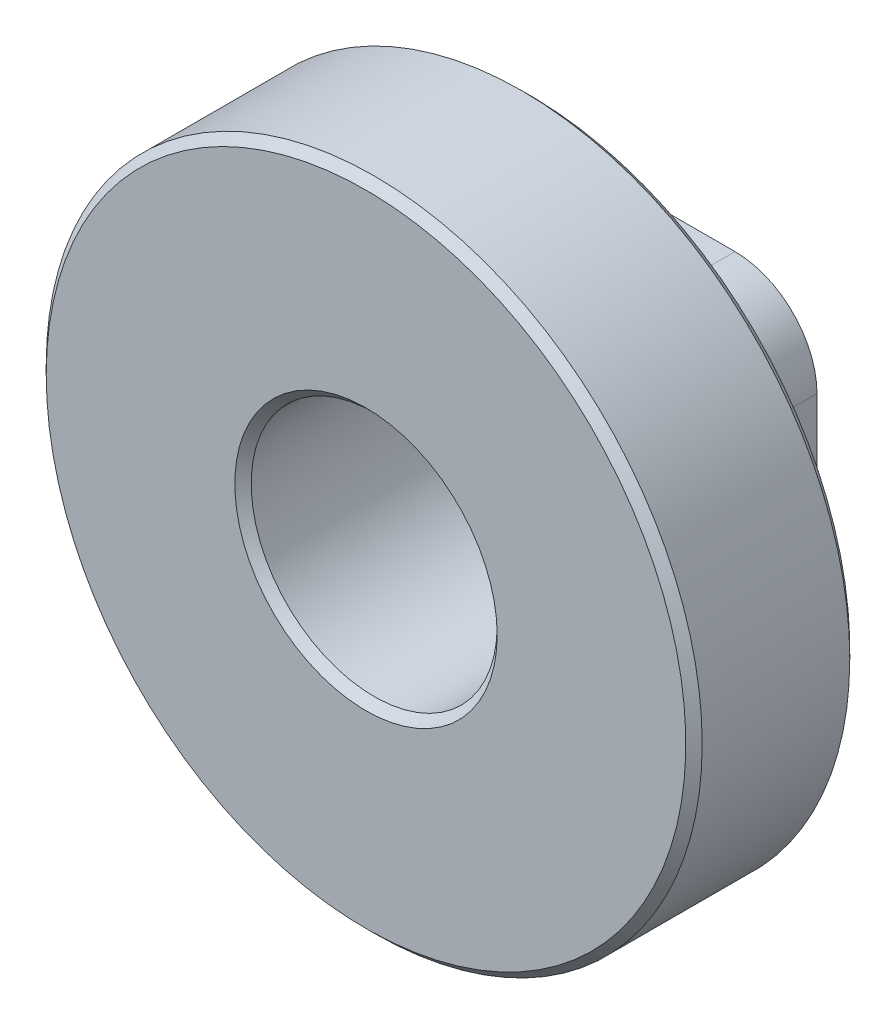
ISO-10303-21;
HEADER;
FILE_DESCRIPTION(('STEP AP214'),'2;1');
FILE_NAME('part.step','',(''),(''),'','','');
FILE_SCHEMA(('AUTOMOTIVE_DESIGN { 1 0 10303 214 1 1 1 1 }'));
ENDSEC;
DATA;
#1=APPLICATION_CONTEXT('core data for automotive mechanical design processes');
#2=APPLICATION_PROTOCOL_DEFINITION('international standard','automotive_design',2000,#1);
#3=PRODUCT_CONTEXT('',#1,'mechanical');
#4=PRODUCT('Part','Part','',(#3));
#5=PRODUCT_RELATED_PRODUCT_CATEGORY('part','',(#4));
#6=PRODUCT_DEFINITION_FORMATION('','',#4);
#7=PRODUCT_DEFINITION_CONTEXT('part definition',#1,'design');
#8=PRODUCT_DEFINITION('design','',#6,#7);
#9=PRODUCT_DEFINITION_SHAPE('','',#8);
#10=(LENGTH_UNIT() NAMED_UNIT(*) SI_UNIT(.MILLI.,.METRE.));
#11=(NAMED_UNIT(*) PLANE_ANGLE_UNIT() SI_UNIT($,.RADIAN.));
#12=(NAMED_UNIT(*) SI_UNIT($,.STERADIAN.) SOLID_ANGLE_UNIT());
#13=UNCERTAINTY_MEASURE_WITH_UNIT(LENGTH_MEASURE(1.E-05),#10,'distance_accuracy_value','');
#14=(GEOMETRIC_REPRESENTATION_CONTEXT(3) GLOBAL_UNCERTAINTY_ASSIGNED_CONTEXT((#13)) GLOBAL_UNIT_ASSIGNED_CONTEXT((#10,
#11,#12)) REPRESENTATION_CONTEXT('',''));
#15=CARTESIAN_POINT('',(0.,0.,0.));
#16=DIRECTION('',(0.,0.,1.));
#17=DIRECTION('',(1.,0.,0.));
#18=AXIS2_PLACEMENT_3D('',#15,#16,#17);
#19=CARTESIAN_POINT('',(0.,0.,-1.5));
#20=DIRECTION('',(0.,0.,1.));
#21=DIRECTION('',(1.,0.,0.));
#22=AXIS2_PLACEMENT_3D('',#19,#20,#21);
#23=PLANE('',#22);
#24=CARTESIAN_POINT('',(0.,0.,-1.5));
#25=DIRECTION('',(0.,0.,1.));
#26=DIRECTION('',(1.,0.,0.));
#27=AXIS2_PLACEMENT_3D('',#24,#25,#26);
#28=CIRCLE('',#27,1.6);
#29=CARTESIAN_POINT('',(1.6,0.,-1.5));
#30=VERTEX_POINT('',#29);
#31=EDGE_CURVE('E154',#30,#30,#28,.T.);
#32=ORIENTED_EDGE('',*,*,#31,.T.);
#33=EDGE_LOOP('',(#32));
#34=FACE_BOUND('',#33,.T.);
#35=CARTESIAN_POINT('',(1.50000000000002,1.5,-1.5));
#36=DIRECTION('',(0.,0.,-1.));
#37=DIRECTION('',(1.,0.,0.));
#38=AXIS2_PLACEMENT_3D('',#35,#36,#37);
#39=CIRCLE('',#38,1.);
#40=CARTESIAN_POINT('',(1.50000000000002,2.5,-1.5));
#41=VERTEX_POINT('',#40);
#42=CARTESIAN_POINT('',(2.50000000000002,1.5,-1.5));
#43=VERTEX_POINT('',#42);
#44=EDGE_CURVE('E116',#41,#43,#39,.T.);
#45=ORIENTED_EDGE('',*,*,#44,.T.);
#46=DIRECTION('',(0.,-1.,0.));
#47=VECTOR('',#46,1.);
#48=CARTESIAN_POINT('',(2.50000000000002,1.5,-1.5));
#49=LINE('',#48,#47);
#50=CARTESIAN_POINT('',(2.5,-1.5,-1.5));
#51=VERTEX_POINT('',#50);
#52=EDGE_CURVE('E114',#43,#51,#49,.T.);
#53=ORIENTED_EDGE('',*,*,#52,.T.);
#54=CARTESIAN_POINT('',(1.5,-1.5,-1.5));
#55=DIRECTION('',(0.,0.,-1.));
#56=DIRECTION('',(1.,0.,0.));
#57=AXIS2_PLACEMENT_3D('',#54,#55,#56);
#58=CIRCLE('',#57,1.);
#59=CARTESIAN_POINT('',(1.5,-2.5,-1.5));
#60=VERTEX_POINT('',#59);
#61=EDGE_CURVE('E46',#51,#60,#58,.T.);
#62=ORIENTED_EDGE('',*,*,#61,.T.);
#63=DIRECTION('',(-1.,0.,0.));
#64=VECTOR('',#63,1.);
#65=CARTESIAN_POINT('',(1.5,-2.5,-1.5));
#66=LINE('',#65,#64);
#67=CARTESIAN_POINT('',(-1.5,-2.5,-1.5));
#68=VERTEX_POINT('',#67);
#69=EDGE_CURVE('E104',#60,#68,#66,.T.);
#70=ORIENTED_EDGE('',*,*,#69,.T.);
#71=CARTESIAN_POINT('',(-1.5,-1.5,-1.5));
#72=DIRECTION('',(0.,0.,-1.));
#73=DIRECTION('',(1.,0.,0.));
#74=AXIS2_PLACEMENT_3D('',#71,#72,#73);
#75=CIRCLE('',#74,1.);
#76=CARTESIAN_POINT('',(-2.5,-1.5,-1.5));
#77=VERTEX_POINT('',#76);
#78=EDGE_CURVE('E109',#68,#77,#75,.T.);
#79=ORIENTED_EDGE('',*,*,#78,.T.);
#80=DIRECTION('',(0.,1.,0.));
#81=VECTOR('',#80,1.);
#82=CARTESIAN_POINT('',(-2.49999999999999,1.5,-1.5));
#83=LINE('',#82,#81);
#84=CARTESIAN_POINT('',(-2.49999999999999,1.5,-1.5));
#85=VERTEX_POINT('',#84);
#86=EDGE_CURVE('E121',#77,#85,#83,.T.);
#87=ORIENTED_EDGE('',*,*,#86,.T.);
#88=CARTESIAN_POINT('',(-1.49999999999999,1.5,-1.5));
#89=DIRECTION('',(0.,0.,-1.));
#90=DIRECTION('',(1.,0.,0.));
#91=AXIS2_PLACEMENT_3D('',#88,#89,#90);
#92=CIRCLE('',#91,1.);
#93=CARTESIAN_POINT('',(-1.49999999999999,2.5,-1.5));
#94=VERTEX_POINT('',#93);
#95=EDGE_CURVE('E124',#85,#94,#92,.T.);
#96=ORIENTED_EDGE('',*,*,#95,.T.);
#97=DIRECTION('',(1.,0.,0.));
#98=VECTOR('',#97,1.);
#99=CARTESIAN_POINT('',(1.50000000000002,2.5,-1.5));
#100=LINE('',#99,#98);
#101=EDGE_CURVE('E127',#94,#41,#100,.T.);
#102=ORIENTED_EDGE('',*,*,#101,.T.);
#103=EDGE_LOOP('',(#45,#53,#62,#70,#79,#87,#96,#102));
#104=FACE_BOUND('',#103,.T.);
#105=ADVANCED_FACE('F31',(#34,#104),#23,.F.);
#106=CARTESIAN_POINT('',(0.,0.,1.5));
#107=DIRECTION('',(0.,0.,-1.));
#108=DIRECTION('',(-1.,0.,0.));
#109=AXIS2_PLACEMENT_3D('',#106,#107,#108);
#110=CYLINDRICAL_SURFACE('',#109,4.);
#111=CARTESIAN_POINT('',(0.,0.,-0.399999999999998));
#112=DIRECTION('',(0.,0.,-1.));
#113=DIRECTION('',(-1.,0.,0.));
#114=AXIS2_PLACEMENT_3D('',#111,#112,#113);
#115=CIRCLE('',#114,4.);
#116=CARTESIAN_POINT('',(-4.00000000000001,0.,-0.399999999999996));
#117=VERTEX_POINT('',#116);
#118=EDGE_CURVE('E11',#117,#117,#115,.F.);
#119=CARTESIAN_POINT('',(0.,0.,1.4));
#120=DIRECTION('',(0.,0.,1.));
#121=DIRECTION('',(1.,0.,0.));
#122=AXIS2_PLACEMENT_3D('',#119,#120,#121);
#123=CIRCLE('',#122,4.);
#124=CARTESIAN_POINT('',(-4.00000000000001,0.,1.4));
#125=VERTEX_POINT('',#124);
#126=EDGE_CURVE('E178',#125,#125,#123,.F.);
#127=CARTESIAN_POINT('',(-4.00000000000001,0.,-0.399999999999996));
#128=CARTESIAN_POINT('',(-4.00000000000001,0.,-0.381249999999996));
#129=CARTESIAN_POINT('',(-4.00000000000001,0.,-0.362499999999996));
#130=CARTESIAN_POINT('',(-4.00000000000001,0.,-0.324999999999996));
#131=CARTESIAN_POINT('',(-4.00000000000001,0.,-0.306249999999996));
#132=CARTESIAN_POINT('',(-4.00000000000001,0.,-0.268749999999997));
#133=CARTESIAN_POINT('',(-4.00000000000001,0.,-0.249999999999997));
#134=CARTESIAN_POINT('',(-4.00000000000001,0.,-0.212499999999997));
#135=CARTESIAN_POINT('',(-4.00000000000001,0.,-0.193749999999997));
#136=CARTESIAN_POINT('',(-4.00000000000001,0.,-0.156249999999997));
#137=CARTESIAN_POINT('',(-4.00000000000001,0.,-0.137499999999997));
#138=CARTESIAN_POINT('',(-4.00000000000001,0.,-0.0999999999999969));
#139=CARTESIAN_POINT('',(-4.00000000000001,0.,-0.081249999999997));
#140=CARTESIAN_POINT('',(-4.00000000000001,0.,-0.0437499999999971));
#141=CARTESIAN_POINT('',(-4.00000000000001,0.,-0.0249999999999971));
#142=CARTESIAN_POINT('',(-4.00000000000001,0.,0.0125000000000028));
#143=CARTESIAN_POINT('',(-4.00000000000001,0.,0.0312500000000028));
#144=CARTESIAN_POINT('',(-4.00000000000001,0.,0.0687500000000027));
#145=CARTESIAN_POINT('',(-4.00000000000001,0.,0.0875000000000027));
#146=CARTESIAN_POINT('',(-4.00000000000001,0.,0.125000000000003));
#147=CARTESIAN_POINT('',(-4.00000000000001,0.,0.143750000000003));
#148=CARTESIAN_POINT('',(-4.00000000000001,0.,0.181250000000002));
#149=CARTESIAN_POINT('',(-4.00000000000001,0.,0.200000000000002));
#150=CARTESIAN_POINT('',(-4.00000000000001,0.,0.237500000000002));
#151=CARTESIAN_POINT('',(-4.00000000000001,0.,0.256250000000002));
#152=CARTESIAN_POINT('',(-4.00000000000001,0.,0.293750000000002));
#153=CARTESIAN_POINT('',(-4.00000000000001,0.,0.312500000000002));
#154=CARTESIAN_POINT('',(-4.00000000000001,0.,0.350000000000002));
#155=CARTESIAN_POINT('',(-4.00000000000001,0.,0.368750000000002));
#156=CARTESIAN_POINT('',(-4.00000000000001,0.,0.406250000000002));
#157=CARTESIAN_POINT('',(-4.00000000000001,0.,0.425000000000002));
#158=CARTESIAN_POINT('',(-4.00000000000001,0.,0.462500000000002));
#159=CARTESIAN_POINT('',(-4.00000000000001,0.,0.481250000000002));
#160=CARTESIAN_POINT('',(-4.00000000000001,0.,0.518750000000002));
#161=CARTESIAN_POINT('',(-4.00000000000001,0.,0.537500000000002));
#162=CARTESIAN_POINT('',(-4.00000000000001,0.,0.575000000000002));
#163=CARTESIAN_POINT('',(-4.00000000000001,0.,0.593750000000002));
#164=CARTESIAN_POINT('',(-4.00000000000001,0.,0.631250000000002));
#165=CARTESIAN_POINT('',(-4.00000000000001,0.,0.650000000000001));
#166=CARTESIAN_POINT('',(-4.00000000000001,0.,0.687500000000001));
#167=CARTESIAN_POINT('',(-4.00000000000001,0.,0.706250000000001));
#168=CARTESIAN_POINT('',(-4.00000000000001,0.,0.743750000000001));
#169=CARTESIAN_POINT('',(-4.00000000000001,0.,0.762500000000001));
#170=CARTESIAN_POINT('',(-4.00000000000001,0.,0.800000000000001));
#171=CARTESIAN_POINT('',(-4.00000000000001,0.,0.818750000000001));
#172=CARTESIAN_POINT('',(-4.00000000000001,0.,0.856250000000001));
#173=CARTESIAN_POINT('',(-4.00000000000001,0.,0.875000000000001));
#174=CARTESIAN_POINT('',(-4.00000000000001,0.,0.912500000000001));
#175=CARTESIAN_POINT('',(-4.00000000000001,0.,0.931250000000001));
#176=CARTESIAN_POINT('',(-4.00000000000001,0.,0.968750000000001));
#177=CARTESIAN_POINT('',(-4.00000000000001,0.,0.987500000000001));
#178=CARTESIAN_POINT('',(-4.00000000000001,0.,1.025));
#179=CARTESIAN_POINT('',(-4.00000000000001,0.,1.04375));
#180=CARTESIAN_POINT('',(-4.00000000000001,0.,1.08125));
#181=CARTESIAN_POINT('',(-4.00000000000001,0.,1.1));
#182=CARTESIAN_POINT('',(-4.00000000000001,0.,1.1375));
#183=CARTESIAN_POINT('',(-4.00000000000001,0.,1.15625));
#184=CARTESIAN_POINT('',(-4.00000000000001,0.,1.19375));
#185=CARTESIAN_POINT('',(-4.00000000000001,0.,1.2125));
#186=CARTESIAN_POINT('',(-4.00000000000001,0.,1.25));
#187=CARTESIAN_POINT('',(-4.00000000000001,0.,1.26875));
#188=CARTESIAN_POINT('',(-4.00000000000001,0.,1.30625));
#189=CARTESIAN_POINT('',(-4.00000000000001,0.,1.325));
#190=CARTESIAN_POINT('',(-4.00000000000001,0.,1.3625));
#191=CARTESIAN_POINT('',(-4.00000000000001,0.,1.38125));
#192=CARTESIAN_POINT('',(-4.00000000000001,0.,1.4));
#193=B_SPLINE_CURVE_WITH_KNOTS('',3,(#127,#128,#129,#130,#131,#132,#133,#134,#135,#136,#137,
#138,#139,#140,#141,#142,#143,#144,#145,#146,#147,#148,#149,#150,#151,#152,#153,#154,#155,#156,
#157,#158,#159,#160,#161,#162,#163,#164,#165,#166,#167,#168,#169,#170,#171,#172,#173,#174,#175,
#176,#177,#178,#179,#180,#181,#182,#183,#184,#185,#186,#187,#188,#189,#190,#191,#192),
.UNSPECIFIED.,.F.,.F.,(4,2,2,2,2,2,2,2,2,2,2,2,2,2,2,2,2,2,2,2,2,2,2,2,2,2,2,2,2,2,2,2,4),(0.,
0.0562499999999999,0.1125,0.16875,0.225,0.281249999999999,0.337499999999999,0.393749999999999,
0.449999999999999,0.506249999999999,0.562499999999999,0.618749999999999,0.674999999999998,
0.731249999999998,0.787499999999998,0.843749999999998,0.899999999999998,0.956249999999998,
1.0125,1.06875,1.125,1.18125,1.2375,1.29375,1.35,1.40625,1.4625,1.51875,1.575,1.63125,1.6875,
1.74375,1.8),.UNSPECIFIED.);
#194=EDGE_CURVE('BSEAM33',#117,#125,#193,.T.);
#195=ORIENTED_EDGE('',*,*,#118,.T.);
#196=ORIENTED_EDGE('',*,*,#126,.T.);
#197=ORIENTED_EDGE('',*,*,#194,.T.);
#198=ORIENTED_EDGE('',*,*,#194,.F.);
#199=EDGE_LOOP('',(#195,#197,#196,#198));
#200=FACE_BOUND('',#199,.T.);
#201=ADVANCED_FACE('F33',(#200),#110,.T.);
#202=CARTESIAN_POINT('',(0.,0.,1.5));
#203=DIRECTION('',(0.,0.,1.));
#204=DIRECTION('',(1.,0.,0.));
#205=AXIS2_PLACEMENT_3D('',#202,#203,#204);
#206=PLANE('',#205);
#207=CARTESIAN_POINT('',(0.,0.,1.5));
#208=DIRECTION('',(0.,0.,1.));
#209=DIRECTION('',(1.,0.,0.));
#210=AXIS2_PLACEMENT_3D('',#207,#208,#209);
#211=CIRCLE('',#210,1.6);
#212=CARTESIAN_POINT('',(1.6,0.,1.5));
#213=VERTEX_POINT('',#212);
#214=EDGE_CURVE('E175',#213,#213,#211,.F.);
#215=ORIENTED_EDGE('',*,*,#214,.T.);
#216=EDGE_LOOP('',(#215));
#217=FACE_BOUND('',#216,.T.);
#218=CARTESIAN_POINT('',(0.,0.,1.5));
#219=DIRECTION('',(0.,0.,1.));
#220=DIRECTION('',(1.,0.,0.));
#221=AXIS2_PLACEMENT_3D('',#218,#219,#220);
#222=CIRCLE('',#221,3.9);
#223=CARTESIAN_POINT('',(-3.9,0.,1.5));
#224=VERTEX_POINT('',#223);
#225=EDGE_CURVE('E172',#224,#224,#222,.T.);
#226=ORIENTED_EDGE('',*,*,#225,.T.);
#227=EDGE_LOOP('',(#226));
#228=FACE_BOUND('',#227,.T.);
#229=ADVANCED_FACE('F203',(#217,#228),#206,.T.);
#230=CARTESIAN_POINT('',(0.,0.,1.5));
#231=DIRECTION('',(0.,0.,-1.));
#232=DIRECTION('',(-1.,0.,0.));
#233=AXIS2_PLACEMENT_3D('',#230,#231,#232);
#234=CYLINDRICAL_SURFACE('',#233,1.5);
#235=CARTESIAN_POINT('',(0.,0.,-1.4));
#236=DIRECTION('',(0.,0.,1.));
#237=DIRECTION('',(1.,0.,0.));
#238=AXIS2_PLACEMENT_3D('',#235,#236,#237);
#239=CIRCLE('',#238,1.5);
#240=CARTESIAN_POINT('',(1.5,0.,-1.4));
#241=VERTEX_POINT('',#240);
#242=EDGE_CURVE('E169',#241,#241,#239,.F.);
#243=ORIENTED_EDGE('',*,*,#242,.T.);
#244=EDGE_LOOP('',(#243));
#245=FACE_BOUND('',#244,.T.);
#246=CARTESIAN_POINT('',(0.,0.,1.4));
#247=DIRECTION('',(0.,0.,1.));
#248=DIRECTION('',(1.,0.,0.));
#249=AXIS2_PLACEMENT_3D('',#246,#247,#248);
#250=CIRCLE('',#249,1.5);
#251=CARTESIAN_POINT('',(1.5,0.,1.4));
#252=VERTEX_POINT('',#251);
#253=EDGE_CURVE('E166',#252,#252,#250,.T.);
#254=ORIENTED_EDGE('',*,*,#253,.T.);
#255=EDGE_LOOP('',(#254));
#256=FACE_BOUND('',#255,.T.);
#257=ADVANCED_FACE('F206',(#245,#256),#234,.F.);
#258=CARTESIAN_POINT('',(0.,0.,-0.5));
#259=DIRECTION('',(0.,0.,-1.));
#260=DIRECTION('',(-1.,0.,0.));
#261=AXIS2_PLACEMENT_3D('',#258,#259,#260);
#262=PLANE('',#261);
#263=CARTESIAN_POINT('',(0.,0.,-0.5));
#264=DIRECTION('',(0.,0.,-1.));
#265=DIRECTION('',(-1.,0.,0.));
#266=AXIS2_PLACEMENT_3D('',#263,#264,#265);
#267=CIRCLE('',#266,3.9);
#268=CARTESIAN_POINT('',(-3.90000000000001,0.,-0.500000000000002));
#269=VERTEX_POINT('',#268);
#270=EDGE_CURVE('E39',#269,#269,#267,.T.);
#271=ORIENTED_EDGE('',*,*,#270,.T.);
#272=EDGE_LOOP('',(#271));
#273=FACE_BOUND('',#272,.T.);
#274=DIRECTION('',(1.,0.,0.));
#275=VECTOR('',#274,1.);
#276=CARTESIAN_POINT('',(1.50000000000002,2.5,-0.5));
#277=LINE('',#276,#275);
#278=CARTESIAN_POINT('',(-1.49999999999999,2.5,-0.5));
#279=VERTEX_POINT('',#278);
#280=CARTESIAN_POINT('',(1.50000000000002,2.5,-0.5));
#281=VERTEX_POINT('',#280);
#282=EDGE_CURVE('E148',#279,#281,#277,.T.);
#283=ORIENTED_EDGE('',*,*,#282,.F.);
#284=CARTESIAN_POINT('',(-1.49999999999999,1.5,-0.5));
#285=DIRECTION('',(0.,0.,-1.));
#286=DIRECTION('',(1.,0.,0.));
#287=AXIS2_PLACEMENT_3D('',#284,#285,#286);
#288=CIRCLE('',#287,1.);
#289=CARTESIAN_POINT('',(-2.49999999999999,1.5,-0.5));
#290=VERTEX_POINT('',#289);
#291=EDGE_CURVE('E145',#290,#279,#288,.T.);
#292=ORIENTED_EDGE('',*,*,#291,.F.);
#293=DIRECTION('',(0.,1.,0.));
#294=VECTOR('',#293,1.);
#295=CARTESIAN_POINT('',(-2.49999999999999,1.5,-0.5));
#296=LINE('',#295,#294);
#297=CARTESIAN_POINT('',(-2.5,-1.5,-0.5));
#298=VERTEX_POINT('',#297);
#299=EDGE_CURVE('E142',#298,#290,#296,.T.);
#300=ORIENTED_EDGE('',*,*,#299,.F.);
#301=CARTESIAN_POINT('',(-1.5,-1.5,-0.5));
#302=DIRECTION('',(0.,0.,-1.));
#303=DIRECTION('',(1.,0.,0.));
#304=AXIS2_PLACEMENT_3D('',#301,#302,#303);
#305=CIRCLE('',#304,1.);
#306=CARTESIAN_POINT('',(-1.5,-2.5,-0.5));
#307=VERTEX_POINT('',#306);
#308=EDGE_CURVE('E139',#307,#298,#305,.T.);
#309=ORIENTED_EDGE('',*,*,#308,.F.);
#310=DIRECTION('',(-1.,0.,0.));
#311=VECTOR('',#310,1.);
#312=CARTESIAN_POINT('',(1.5,-2.5,-0.5));
#313=LINE('',#312,#311);
#314=CARTESIAN_POINT('',(1.5,-2.5,-0.5));
#315=VERTEX_POINT('',#314);
#316=EDGE_CURVE('E137',#315,#307,#313,.T.);
#317=ORIENTED_EDGE('',*,*,#316,.F.);
#318=CARTESIAN_POINT('',(1.5,-1.5,-0.5));
#319=DIRECTION('',(0.,0.,-1.));
#320=DIRECTION('',(1.,0.,0.));
#321=AXIS2_PLACEMENT_3D('',#318,#319,#320);
#322=CIRCLE('',#321,1.);
#323=CARTESIAN_POINT('',(2.5,-1.5,-0.5));
#324=VERTEX_POINT('',#323);
#325=EDGE_CURVE('E54',#324,#315,#322,.T.);
#326=ORIENTED_EDGE('',*,*,#325,.F.);
#327=DIRECTION('',(0.,-1.,0.));
#328=VECTOR('',#327,1.);
#329=CARTESIAN_POINT('',(2.50000000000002,1.5,-0.5));
#330=LINE('',#329,#328);
#331=CARTESIAN_POINT('',(2.50000000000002,1.5,-0.5));
#332=VERTEX_POINT('',#331);
#333=EDGE_CURVE('E133',#332,#324,#330,.T.);
#334=ORIENTED_EDGE('',*,*,#333,.F.);
#335=CARTESIAN_POINT('',(1.50000000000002,1.5,-0.5));
#336=DIRECTION('',(0.,0.,-1.));
#337=DIRECTION('',(1.,0.,0.));
#338=AXIS2_PLACEMENT_3D('',#335,#336,#337);
#339=CIRCLE('',#338,1.);
#340=EDGE_CURVE('E130',#281,#332,#339,.T.);
#341=ORIENTED_EDGE('',*,*,#340,.F.);
#342=EDGE_LOOP('',(#283,#292,#300,#309,#317,#326,#334,#341));
#343=FACE_BOUND('',#342,.T.);
#344=ADVANCED_FACE('F183',(#273,#343),#262,.T.);
#345=CARTESIAN_POINT('',(1.50000000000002,1.5,-0.5));
#346=DIRECTION('',(0.,0.,-1.));
#347=DIRECTION('',(-1.,0.,0.));
#348=AXIS2_PLACEMENT_3D('',#345,#346,#347);
#349=CYLINDRICAL_SURFACE('',#348,1.);
#350=ORIENTED_EDGE('',*,*,#44,.F.);
#351=DIRECTION('',(0.,0.,-1.));
#352=VECTOR('',#351,1.);
#353=CARTESIAN_POINT('',(1.50000000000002,2.5,-0.5));
#354=LINE('',#353,#352);
#355=EDGE_CURVE('E152',#281,#41,#354,.T.);
#356=ORIENTED_EDGE('',*,*,#355,.F.);
#357=ORIENTED_EDGE('',*,*,#340,.T.);
#358=DIRECTION('',(0.,0.,-1.));
#359=VECTOR('',#358,1.);
#360=CARTESIAN_POINT('',(2.50000000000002,1.5,-0.5));
#361=LINE('',#360,#359);
#362=EDGE_CURVE('E151',#332,#43,#361,.T.);
#363=ORIENTED_EDGE('',*,*,#362,.T.);
#364=EDGE_LOOP('',(#350,#356,#357,#363));
#365=FACE_BOUND('',#364,.T.);
#366=ADVANCED_FACE('F236',(#365),#349,.T.);
#367=CARTESIAN_POINT('',(1.50000000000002,2.5,-0.5));
#368=DIRECTION('',(0.,1.,0.));
#369=DIRECTION('',(-1.,0.,0.));
#370=AXIS2_PLACEMENT_3D('',#367,#368,#369);
#371=PLANE('',#370);
#372=ORIENTED_EDGE('',*,*,#101,.F.);
#373=DIRECTION('',(0.,0.,-1.));
#374=VECTOR('',#373,1.);
#375=CARTESIAN_POINT('',(-1.49999999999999,2.5,-0.5));
#376=LINE('',#375,#374);
#377=EDGE_CURVE('E155',#279,#94,#376,.T.);
#378=ORIENTED_EDGE('',*,*,#377,.F.);
#379=ORIENTED_EDGE('',*,*,#282,.T.);
#380=ORIENTED_EDGE('',*,*,#355,.T.);
#381=EDGE_LOOP('',(#372,#378,#379,#380));
#382=FACE_BOUND('',#381,.T.);
#383=ADVANCED_FACE('F232',(#382),#371,.T.);
#384=CARTESIAN_POINT('',(-1.49999999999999,1.5,-0.5));
#385=DIRECTION('',(0.,0.,-1.));
#386=DIRECTION('',(-1.,0.,0.));
#387=AXIS2_PLACEMENT_3D('',#384,#385,#386);
#388=CYLINDRICAL_SURFACE('',#387,1.);
#389=ORIENTED_EDGE('',*,*,#95,.F.);
#390=DIRECTION('',(0.,0.,-1.));
#391=VECTOR('',#390,1.);
#392=CARTESIAN_POINT('',(-2.49999999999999,1.5,-0.5));
#393=LINE('',#392,#391);
#394=EDGE_CURVE('E157',#290,#85,#393,.T.);
#395=ORIENTED_EDGE('',*,*,#394,.F.);
#396=ORIENTED_EDGE('',*,*,#291,.T.);
#397=ORIENTED_EDGE('',*,*,#377,.T.);
#398=EDGE_LOOP('',(#389,#395,#396,#397));
#399=FACE_BOUND('',#398,.T.);
#400=ADVANCED_FACE('F235',(#399),#388,.T.);
#401=CARTESIAN_POINT('',(-2.49999999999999,1.5,-0.5));
#402=DIRECTION('',(-1.,0.,0.));
#403=DIRECTION('',(0.,-1.,0.));
#404=AXIS2_PLACEMENT_3D('',#401,#402,#403);
#405=PLANE('',#404);
#406=ORIENTED_EDGE('',*,*,#86,.F.);
#407=DIRECTION('',(0.,0.,-1.));
#408=VECTOR('',#407,1.);
#409=CARTESIAN_POINT('',(-2.5,-1.5,-0.5));
#410=LINE('',#409,#408);
#411=EDGE_CURVE('E159',#298,#77,#410,.T.);
#412=ORIENTED_EDGE('',*,*,#411,.F.);
#413=ORIENTED_EDGE('',*,*,#299,.T.);
#414=ORIENTED_EDGE('',*,*,#394,.T.);
#415=EDGE_LOOP('',(#406,#412,#413,#414));
#416=FACE_BOUND('',#415,.T.);
#417=ADVANCED_FACE('F240',(#416),#405,.T.);
#418=CARTESIAN_POINT('',(-1.5,-1.5,-0.5));
#419=DIRECTION('',(0.,0.,-1.));
#420=DIRECTION('',(-1.,0.,0.));
#421=AXIS2_PLACEMENT_3D('',#418,#419,#420);
#422=CYLINDRICAL_SURFACE('',#421,1.);
#423=ORIENTED_EDGE('',*,*,#78,.F.);
#424=DIRECTION('',(0.,0.,-1.));
#425=VECTOR('',#424,1.);
#426=CARTESIAN_POINT('',(-1.5,-2.5,-0.5));
#427=LINE('',#426,#425);
#428=EDGE_CURVE('E100',#307,#68,#427,.T.);
#429=ORIENTED_EDGE('',*,*,#428,.F.);
#430=ORIENTED_EDGE('',*,*,#308,.T.);
#431=ORIENTED_EDGE('',*,*,#411,.T.);
#432=EDGE_LOOP('',(#423,#429,#430,#431));
#433=FACE_BOUND('',#432,.T.);
#434=ADVANCED_FACE('F244',(#433),#422,.T.);
#435=CARTESIAN_POINT('',(1.5,-2.5,-0.5));
#436=DIRECTION('',(0.,-1.,0.));
#437=DIRECTION('',(1.,0.,0.));
#438=AXIS2_PLACEMENT_3D('',#435,#436,#437);
#439=PLANE('',#438);
#440=ORIENTED_EDGE('',*,*,#69,.F.);
#441=DIRECTION('',(0.,0.,-1.));
#442=VECTOR('',#441,1.);
#443=CARTESIAN_POINT('',(1.5,-2.5,-0.5));
#444=LINE('',#443,#442);
#445=EDGE_CURVE('E95',#315,#60,#444,.T.);
#446=ORIENTED_EDGE('',*,*,#445,.F.);
#447=ORIENTED_EDGE('',*,*,#316,.T.);
#448=ORIENTED_EDGE('',*,*,#428,.T.);
#449=EDGE_LOOP('',(#440,#446,#447,#448));
#450=FACE_BOUND('',#449,.T.);
#451=ADVANCED_FACE('F105',(#450),#439,.T.);
#452=CARTESIAN_POINT('',(1.5,-1.5,-0.5));
#453=DIRECTION('',(0.,0.,-1.));
#454=DIRECTION('',(-1.,0.,0.));
#455=AXIS2_PLACEMENT_3D('',#452,#453,#454);
#456=CYLINDRICAL_SURFACE('',#455,1.);
#457=ORIENTED_EDGE('',*,*,#61,.F.);
#458=DIRECTION('',(0.,0.,-1.));
#459=VECTOR('',#458,1.);
#460=CARTESIAN_POINT('',(2.5,-1.5,-0.5));
#461=LINE('',#460,#459);
#462=EDGE_CURVE('E101',#324,#51,#461,.T.);
#463=ORIENTED_EDGE('',*,*,#462,.F.);
#464=ORIENTED_EDGE('',*,*,#325,.T.);
#465=ORIENTED_EDGE('',*,*,#445,.T.);
#466=EDGE_LOOP('',(#457,#463,#464,#465));
#467=FACE_BOUND('',#466,.T.);
#468=ADVANCED_FACE('F97',(#467),#456,.T.);
#469=CARTESIAN_POINT('',(2.50000000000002,1.5,-0.5));
#470=DIRECTION('',(1.,0.,0.));
#471=DIRECTION('',(0.,1.,0.));
#472=AXIS2_PLACEMENT_3D('',#469,#470,#471);
#473=PLANE('',#472);
#474=ORIENTED_EDGE('',*,*,#52,.F.);
#475=ORIENTED_EDGE('',*,*,#362,.F.);
#476=ORIENTED_EDGE('',*,*,#333,.T.);
#477=ORIENTED_EDGE('',*,*,#462,.T.);
#478=EDGE_LOOP('',(#474,#475,#476,#477));
#479=FACE_BOUND('',#478,.T.);
#480=ADVANCED_FACE('F228',(#479),#473,.T.);
#481=CARTESIAN_POINT('',(0.,0.,-1.5));
#482=DIRECTION('',(0.,0.,-1.));
#483=DIRECTION('',(-1.,0.,0.));
#484=AXIS2_PLACEMENT_3D('',#481,#482,#483);
#485=CONICAL_SURFACE('',#484,1.6,0.785398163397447);
#486=ORIENTED_EDGE('',*,*,#242,.F.);
#487=EDGE_LOOP('',(#486));
#488=FACE_BOUND('',#487,.T.);
#489=ORIENTED_EDGE('',*,*,#31,.F.);
#490=EDGE_LOOP('',(#489));
#491=FACE_BOUND('',#490,.T.);
#492=ADVANCED_FACE('F221',(#488,#491),#485,.F.);
#493=CARTESIAN_POINT('',(0.,0.,1.4));
#494=DIRECTION('',(0.,0.,1.));
#495=DIRECTION('',(1.,0.,0.));
#496=AXIS2_PLACEMENT_3D('',#493,#494,#495);
#497=CONICAL_SURFACE('',#496,1.5,0.78539816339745);
#498=CARTESIAN_POINT('',(1.6,0.,1.5));
#499=CARTESIAN_POINT('',(1.59895833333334,0.,1.49895833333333));
#500=CARTESIAN_POINT('',(1.59791666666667,0.,1.49791666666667));
#501=CARTESIAN_POINT('',(1.59583333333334,0.,1.49583333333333));
#502=CARTESIAN_POINT('',(1.59479166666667,0.,1.49479166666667));
#503=CARTESIAN_POINT('',(1.59270833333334,0.,1.49270833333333));
#504=CARTESIAN_POINT('',(1.59166666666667,0.,1.49166666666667));
#505=CARTESIAN_POINT('',(1.58958333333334,0.,1.48958333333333));
#506=CARTESIAN_POINT('',(1.58854166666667,0.,1.48854166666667));
#507=CARTESIAN_POINT('',(1.58645833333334,0.,1.48645833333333));
#508=CARTESIAN_POINT('',(1.58541666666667,0.,1.48541666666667));
#509=CARTESIAN_POINT('',(1.58333333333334,0.,1.48333333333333));
#510=CARTESIAN_POINT('',(1.58229166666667,0.,1.48229166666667));
#511=CARTESIAN_POINT('',(1.58020833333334,0.,1.48020833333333));
#512=CARTESIAN_POINT('',(1.57916666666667,0.,1.47916666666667));
#513=CARTESIAN_POINT('',(1.57708333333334,0.,1.47708333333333));
#514=CARTESIAN_POINT('',(1.57604166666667,0.,1.47604166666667));
#515=CARTESIAN_POINT('',(1.57395833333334,0.,1.47395833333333));
#516=CARTESIAN_POINT('',(1.57291666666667,0.,1.47291666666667));
#517=CARTESIAN_POINT('',(1.57083333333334,0.,1.47083333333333));
#518=CARTESIAN_POINT('',(1.56979166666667,0.,1.46979166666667));
#519=CARTESIAN_POINT('',(1.56770833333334,0.,1.46770833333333));
#520=CARTESIAN_POINT('',(1.56666666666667,0.,1.46666666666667));
#521=CARTESIAN_POINT('',(1.56458333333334,0.,1.46458333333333));
#522=CARTESIAN_POINT('',(1.56354166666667,0.,1.46354166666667));
#523=CARTESIAN_POINT('',(1.56145833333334,0.,1.46145833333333));
#524=CARTESIAN_POINT('',(1.56041666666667,0.,1.46041666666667));
#525=CARTESIAN_POINT('',(1.55833333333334,0.,1.45833333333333));
#526=CARTESIAN_POINT('',(1.55729166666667,0.,1.45729166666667));
#527=CARTESIAN_POINT('',(1.55520833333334,0.,1.45520833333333));
#528=CARTESIAN_POINT('',(1.55416666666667,0.,1.45416666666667));
#529=CARTESIAN_POINT('',(1.55208333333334,0.,1.45208333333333));
#530=CARTESIAN_POINT('',(1.55104166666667,0.,1.45104166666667));
#531=CARTESIAN_POINT('',(1.54895833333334,0.,1.44895833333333));
#532=CARTESIAN_POINT('',(1.54791666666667,0.,1.44791666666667));
#533=CARTESIAN_POINT('',(1.54583333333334,0.,1.44583333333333));
#534=CARTESIAN_POINT('',(1.54479166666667,0.,1.44479166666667));
#535=CARTESIAN_POINT('',(1.54270833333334,0.,1.44270833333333));
#536=CARTESIAN_POINT('',(1.54166666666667,0.,1.44166666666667));
#537=CARTESIAN_POINT('',(1.53958333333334,0.,1.43958333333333));
#538=CARTESIAN_POINT('',(1.53854166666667,0.,1.43854166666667));
#539=CARTESIAN_POINT('',(1.53645833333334,0.,1.43645833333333));
#540=CARTESIAN_POINT('',(1.53541666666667,0.,1.43541666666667));
#541=CARTESIAN_POINT('',(1.53333333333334,0.,1.43333333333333));
#542=CARTESIAN_POINT('',(1.53229166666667,0.,1.43229166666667));
#543=CARTESIAN_POINT('',(1.53020833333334,0.,1.43020833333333));
#544=CARTESIAN_POINT('',(1.52916666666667,0.,1.42916666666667));
#545=CARTESIAN_POINT('',(1.52708333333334,0.,1.42708333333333));
#546=CARTESIAN_POINT('',(1.52604166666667,0.,1.42604166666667));
#547=CARTESIAN_POINT('',(1.52395833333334,0.,1.42395833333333));
#548=CARTESIAN_POINT('',(1.52291666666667,0.,1.42291666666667));
#549=CARTESIAN_POINT('',(1.52083333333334,0.,1.42083333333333));
#550=CARTESIAN_POINT('',(1.51979166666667,0.,1.41979166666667));
#551=CARTESIAN_POINT('',(1.51770833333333,0.,1.41770833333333));
#552=CARTESIAN_POINT('',(1.51666666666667,0.,1.41666666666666));
#553=CARTESIAN_POINT('',(1.51458333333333,0.,1.41458333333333));
#554=CARTESIAN_POINT('',(1.51354166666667,0.,1.41354166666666));
#555=CARTESIAN_POINT('',(1.51145833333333,0.,1.41145833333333));
#556=CARTESIAN_POINT('',(1.51041666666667,0.,1.41041666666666));
#557=CARTESIAN_POINT('',(1.50833333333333,0.,1.40833333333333));
#558=CARTESIAN_POINT('',(1.50729166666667,0.,1.40729166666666));
#559=CARTESIAN_POINT('',(1.50520833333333,0.,1.40520833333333));
#560=CARTESIAN_POINT('',(1.50416666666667,0.,1.40416666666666));
#561=CARTESIAN_POINT('',(1.50208333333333,0.,1.40208333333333));
#562=CARTESIAN_POINT('',(1.50104166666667,0.,1.40104166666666));
#563=CARTESIAN_POINT('',(1.5,0.,1.4));
#564=B_SPLINE_CURVE_WITH_KNOTS('',3,(#498,#499,#500,#501,#502,#503,#504,#505,#506,#507,#508,
#509,#510,#511,#512,#513,#514,#515,#516,#517,#518,#519,#520,#521,#522,#523,#524,#525,#526,#527,
#528,#529,#530,#531,#532,#533,#534,#535,#536,#537,#538,#539,#540,#541,#542,#543,#544,#545,#546,
#547,#548,#549,#550,#551,#552,#553,#554,#555,#556,#557,#558,#559,#560,#561,#562,#563),
.UNSPECIFIED.,.F.,.F.,(4,2,2,2,2,2,2,2,2,2,2,2,2,2,2,2,2,2,2,2,2,2,2,2,2,2,2,2,2,2,2,2,4),(0.,
0.0044194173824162,0.00883883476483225,0.0132582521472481,0.0176776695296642,0.0220970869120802,
0.0265165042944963,0.0309359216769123,0.0353553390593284,0.0397747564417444,0.0441941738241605,
0.0486135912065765,0.0530330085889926,0.0574524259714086,0.0618718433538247,0.0662912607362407,
0.0707106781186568,0.0751300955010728,0.079549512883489,0.0839689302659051,0.0883883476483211,
0.0928077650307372,0.0972271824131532,0.101646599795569,0.106066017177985,0.110485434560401,
0.114904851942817,0.119324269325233,0.12374368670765,0.128163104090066,0.132582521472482,
0.137001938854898,0.141421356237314),.UNSPECIFIED.);
#565=EDGE_CURVE('BSEAM193',#213,#252,#564,.T.);
#566=ORIENTED_EDGE('',*,*,#214,.F.);
#567=ORIENTED_EDGE('',*,*,#253,.F.);
#568=ORIENTED_EDGE('',*,*,#565,.T.);
#569=ORIENTED_EDGE('',*,*,#565,.F.);
#570=EDGE_LOOP('',(#566,#568,#567,#569));
#571=FACE_BOUND('',#570,.T.);
#572=ADVANCED_FACE('F193',(#571),#497,.F.);
#573=CARTESIAN_POINT('',(0.,0.,1.5));
#574=DIRECTION('',(0.,0.,-1.));
#575=DIRECTION('',(-1.,0.,0.));
#576=AXIS2_PLACEMENT_3D('',#573,#574,#575);
#577=CONICAL_SURFACE('',#576,3.9,0.78539816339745);
#578=CARTESIAN_POINT('',(-4.00000000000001,0.,1.4));
#579=CARTESIAN_POINT('',(-3.99895833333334,0.,1.40104166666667));
#580=CARTESIAN_POINT('',(-3.99791666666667,0.,1.40208333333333));
#581=CARTESIAN_POINT('',(-3.99583333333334,0.,1.40416666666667));
#582=CARTESIAN_POINT('',(-3.99479166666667,0.,1.40520833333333));
#583=CARTESIAN_POINT('',(-3.99270833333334,0.,1.40729166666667));
#584=CARTESIAN_POINT('',(-3.99166666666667,0.,1.40833333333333));
#585=CARTESIAN_POINT('',(-3.98958333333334,0.,1.41041666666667));
#586=CARTESIAN_POINT('',(-3.98854166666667,0.,1.41145833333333));
#587=CARTESIAN_POINT('',(-3.98645833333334,0.,1.41354166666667));
#588=CARTESIAN_POINT('',(-3.98541666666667,0.,1.41458333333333));
#589=CARTESIAN_POINT('',(-3.98333333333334,0.,1.41666666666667));
#590=CARTESIAN_POINT('',(-3.98229166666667,0.,1.41770833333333));
#591=CARTESIAN_POINT('',(-3.98020833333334,0.,1.41979166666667));
#592=CARTESIAN_POINT('',(-3.97916666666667,0.,1.42083333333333));
#593=CARTESIAN_POINT('',(-3.97708333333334,0.,1.42291666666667));
#594=CARTESIAN_POINT('',(-3.97604166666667,0.,1.42395833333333));
#595=CARTESIAN_POINT('',(-3.97395833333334,0.,1.42604166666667));
#596=CARTESIAN_POINT('',(-3.97291666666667,0.,1.42708333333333));
#597=CARTESIAN_POINT('',(-3.97083333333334,0.,1.42916666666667));
#598=CARTESIAN_POINT('',(-3.96979166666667,0.,1.43020833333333));
#599=CARTESIAN_POINT('',(-3.96770833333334,0.,1.43229166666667));
#600=CARTESIAN_POINT('',(-3.96666666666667,0.,1.43333333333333));
#601=CARTESIAN_POINT('',(-3.96458333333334,0.,1.43541666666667));
#602=CARTESIAN_POINT('',(-3.96354166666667,0.,1.43645833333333));
#603=CARTESIAN_POINT('',(-3.96145833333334,0.,1.43854166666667));
#604=CARTESIAN_POINT('',(-3.96041666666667,0.,1.43958333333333));
#605=CARTESIAN_POINT('',(-3.95833333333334,0.,1.44166666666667));
#606=CARTESIAN_POINT('',(-3.95729166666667,0.,1.44270833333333));
#607=CARTESIAN_POINT('',(-3.95520833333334,0.,1.44479166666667));
#608=CARTESIAN_POINT('',(-3.95416666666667,0.,1.44583333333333));
#609=CARTESIAN_POINT('',(-3.95208333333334,0.,1.44791666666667));
#610=CARTESIAN_POINT('',(-3.95104166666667,0.,1.44895833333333));
#611=CARTESIAN_POINT('',(-3.94895833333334,0.,1.45104166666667));
#612=CARTESIAN_POINT('',(-3.94791666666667,0.,1.45208333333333));
#613=CARTESIAN_POINT('',(-3.94583333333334,0.,1.45416666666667));
#614=CARTESIAN_POINT('',(-3.94479166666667,0.,1.45520833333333));
#615=CARTESIAN_POINT('',(-3.94270833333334,0.,1.45729166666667));
#616=CARTESIAN_POINT('',(-3.94166666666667,0.,1.45833333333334));
#617=CARTESIAN_POINT('',(-3.93958333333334,0.,1.46041666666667));
#618=CARTESIAN_POINT('',(-3.93854166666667,0.,1.46145833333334));
#619=CARTESIAN_POINT('',(-3.93645833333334,0.,1.46354166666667));
#620=CARTESIAN_POINT('',(-3.93541666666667,0.,1.46458333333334));
#621=CARTESIAN_POINT('',(-3.93333333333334,0.,1.46666666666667));
#622=CARTESIAN_POINT('',(-3.93229166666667,0.,1.46770833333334));
#623=CARTESIAN_POINT('',(-3.93020833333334,0.,1.46979166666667));
#624=CARTESIAN_POINT('',(-3.92916666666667,0.,1.47083333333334));
#625=CARTESIAN_POINT('',(-3.92708333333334,0.,1.47291666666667));
#626=CARTESIAN_POINT('',(-3.92604166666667,0.,1.47395833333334));
#627=CARTESIAN_POINT('',(-3.92395833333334,0.,1.47604166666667));
#628=CARTESIAN_POINT('',(-3.92291666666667,0.,1.47708333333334));
#629=CARTESIAN_POINT('',(-3.92083333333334,0.,1.47916666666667));
#630=CARTESIAN_POINT('',(-3.91979166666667,0.,1.48020833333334));
#631=CARTESIAN_POINT('',(-3.91770833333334,0.,1.48229166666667));
#632=CARTESIAN_POINT('',(-3.91666666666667,0.,1.48333333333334));
#633=CARTESIAN_POINT('',(-3.91458333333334,0.,1.48541666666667));
#634=CARTESIAN_POINT('',(-3.91354166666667,0.,1.48645833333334));
#635=CARTESIAN_POINT('',(-3.91145833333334,0.,1.48854166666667));
#636=CARTESIAN_POINT('',(-3.91041666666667,0.,1.48958333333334));
#637=CARTESIAN_POINT('',(-3.90833333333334,0.,1.49166666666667));
#638=CARTESIAN_POINT('',(-3.90729166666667,0.,1.49270833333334));
#639=CARTESIAN_POINT('',(-3.90520833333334,0.,1.49479166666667));
#640=CARTESIAN_POINT('',(-3.90416666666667,0.,1.49583333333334));
#641=CARTESIAN_POINT('',(-3.90208333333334,0.,1.49791666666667));
#642=CARTESIAN_POINT('',(-3.90104166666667,0.,1.49895833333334));
#643=CARTESIAN_POINT('',(-3.9,0.,1.5));
#644=B_SPLINE_CURVE_WITH_KNOTS('',3,(#578,#579,#580,#581,#582,#583,#584,#585,#586,#587,#588,
#589,#590,#591,#592,#593,#594,#595,#596,#597,#598,#599,#600,#601,#602,#603,#604,#605,#606,#607,
#608,#609,#610,#611,#612,#613,#614,#615,#616,#617,#618,#619,#620,#621,#622,#623,#624,#625,#626,
#627,#628,#629,#630,#631,#632,#633,#634,#635,#636,#637,#638,#639,#640,#641,#642,#643),
.UNSPECIFIED.,.F.,.F.,(4,2,2,2,2,2,2,2,2,2,2,2,2,2,2,2,2,2,2,2,2,2,2,2,2,2,2,2,2,2,2,2,4),(0.,
0.00441941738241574,0.0088388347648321,0.0132582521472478,0.0176776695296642,0.0220970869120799,
0.0265165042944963,0.030935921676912,0.0353553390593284,0.0397747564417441,0.0441941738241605,
0.0486135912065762,0.0530330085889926,0.0574524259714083,0.0618718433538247,0.0662912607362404,
0.0707106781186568,0.0751300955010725,0.0795495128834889,0.0839689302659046,0.088388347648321,
0.0928077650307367,0.0972271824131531,0.101646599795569,0.106066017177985,0.110485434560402,
0.114904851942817,0.119324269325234,0.123743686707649,0.128163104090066,0.132582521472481,
0.137001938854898,0.141421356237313),.UNSPECIFIED.);
#645=EDGE_CURVE('BSEAM187',#125,#224,#644,.T.);
#646=ORIENTED_EDGE('',*,*,#126,.F.);
#647=ORIENTED_EDGE('',*,*,#225,.F.);
#648=ORIENTED_EDGE('',*,*,#645,.T.);
#649=ORIENTED_EDGE('',*,*,#645,.F.);
#650=EDGE_LOOP('',(#646,#648,#647,#649));
#651=FACE_BOUND('',#650,.T.);
#652=ADVANCED_FACE('F187',(#651),#577,.T.);
#653=CARTESIAN_POINT('',(0.,0.,-0.5));
#654=DIRECTION('',(0.,0.,1.));
#655=DIRECTION('',(1.,0.,0.));
#656=AXIS2_PLACEMENT_3D('',#653,#654,#655);
#657=CONICAL_SURFACE('',#656,3.9,0.78539816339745);
#658=ORIENTED_EDGE('',*,*,#118,.F.);
#659=EDGE_LOOP('',(#658));
#660=FACE_BOUND('',#659,.T.);
#661=ORIENTED_EDGE('',*,*,#270,.F.);
#662=EDGE_LOOP('',(#661));
#663=FACE_BOUND('',#662,.T.);
#664=ADVANCED_FACE('F185',(#660,#663),#657,.T.);
#665=CLOSED_SHELL('',(#105,#201,#229,#257,#344,#366,#383,#400,#417,#434,#451,#468,#480,#492,
#572,#652,#664));
#666=MANIFOLD_SOLID_BREP('B2',#665);
#667=ADVANCED_BREP_SHAPE_REPRESENTATION('',(#18,#666),#14);
#668=SHAPE_DEFINITION_REPRESENTATION(#9,#667);
ENDSEC;
END-ISO-10303-21;
